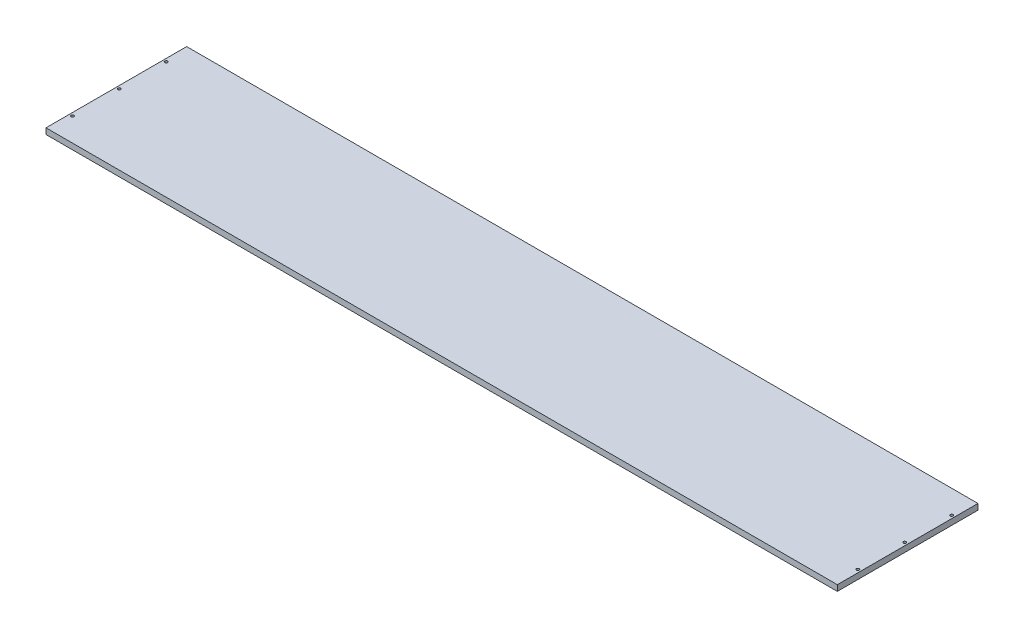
from build123d import *

# Parameters (mm, degrees)
SKETCH1_W                  = 857.25
SKETCH1_H                  = 152.4
BOSS_EXTRUDE1_DEPTH        = 6.35
F_31_0_12_DIAMETER_HOLE1_D = 3.048


with BuildPart() as part:
    # Sketch1 → Boss-Extrude1 (new body)
    with BuildSketch(Plane(origin=(0, 0, 0), x_dir=(1, 0, 0), z_dir=(0, 1, 0))):
        Rectangle(SKETCH1_W, SKETCH1_H)
    extrude(amount=BOSS_EXTRUDE1_DEPTH)

    # 31 _0.12_ Diameter Hole1 (through all)
    with Locations(Plane(origin=(0, 6.35, 0), x_dir=(1, 0, 0), z_dir=(0, 1, 0))):
        with Locations((425.45, 0), (425.45, 50.8), (425.45, -50.8), (-425.45, 0), (-425.45, -50.8), (-425.45, 50.8)):
            Hole(F_31_0_12_DIAMETER_HOLE1_D / 2)


solid = part.part
